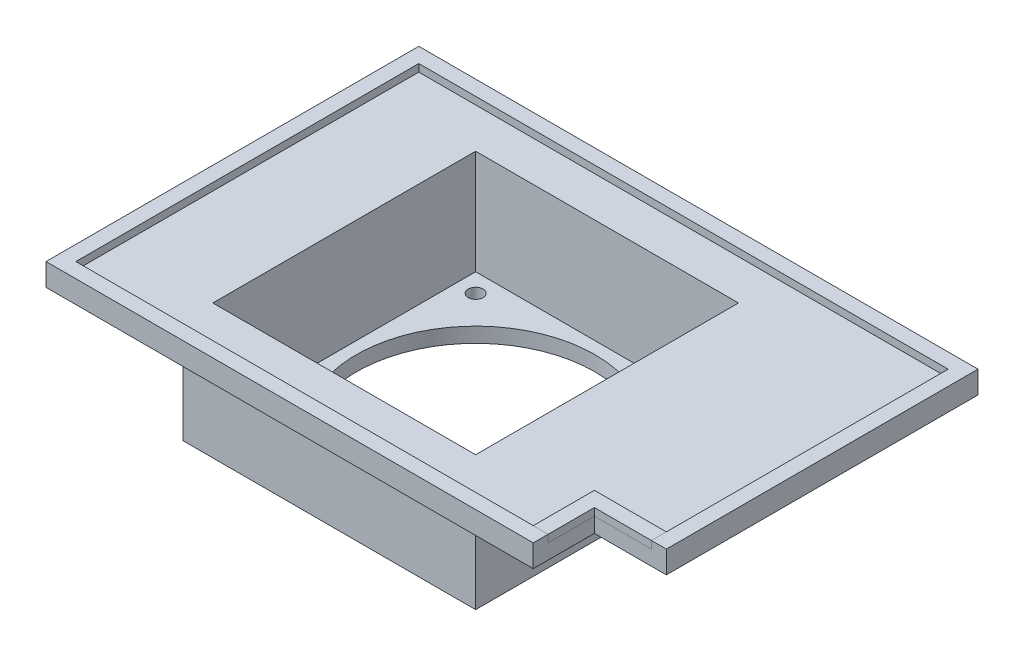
ISO-10303-21;
HEADER;
FILE_DESCRIPTION(('STEP AP214'),'2;1');
FILE_NAME('part.step','',(''),(''),'','','');
FILE_SCHEMA(('AUTOMOTIVE_DESIGN { 1 0 10303 214 1 1 1 1 }'));
ENDSEC;
DATA;
#1=APPLICATION_CONTEXT('core data for automotive mechanical design processes');
#2=APPLICATION_PROTOCOL_DEFINITION('international standard','automotive_design',2000,#1);
#3=PRODUCT_CONTEXT('',#1,'mechanical');
#4=PRODUCT('Part','Part','',(#3));
#5=PRODUCT_RELATED_PRODUCT_CATEGORY('part','',(#4));
#6=PRODUCT_DEFINITION_FORMATION('','',#4);
#7=PRODUCT_DEFINITION_CONTEXT('part definition',#1,'design');
#8=PRODUCT_DEFINITION('design','',#6,#7);
#9=PRODUCT_DEFINITION_SHAPE('','',#8);
#10=(LENGTH_UNIT() NAMED_UNIT(*) SI_UNIT(.MILLI.,.METRE.));
#11=(NAMED_UNIT(*) PLANE_ANGLE_UNIT() SI_UNIT($,.RADIAN.));
#12=(NAMED_UNIT(*) SI_UNIT($,.STERADIAN.) SOLID_ANGLE_UNIT());
#13=UNCERTAINTY_MEASURE_WITH_UNIT(LENGTH_MEASURE(1.E-05),#10,'distance_accuracy_value','');
#14=(GEOMETRIC_REPRESENTATION_CONTEXT(3) GLOBAL_UNCERTAINTY_ASSIGNED_CONTEXT((#13)) GLOBAL_UNIT_ASSIGNED_CONTEXT((#10,
#11,#12)) REPRESENTATION_CONTEXT('',''));
#15=CARTESIAN_POINT('',(0.,0.,0.));
#16=DIRECTION('',(0.,0.,1.));
#17=DIRECTION('',(1.,0.,0.));
#18=AXIS2_PLACEMENT_3D('',#15,#16,#17);
#19=CARTESIAN_POINT('',(126.7,6.,0.));
#20=DIRECTION('',(-1.,0.,0.));
#21=DIRECTION('',(0.,0.,1.));
#22=AXIS2_PLACEMENT_3D('',#19,#20,#21);
#23=PLANE('',#22);
#24=DIRECTION('',(0.,0.,-1.));
#25=VECTOR('',#24,1.);
#26=CARTESIAN_POINT('',(126.7,4.,0.));
#27=LINE('',#26,#25);
#28=CARTESIAN_POINT('',(126.7,4.,-4.));
#29=VERTEX_POINT('',#28);
#30=CARTESIAN_POINT('',(126.7,4.,-20.4));
#31=VERTEX_POINT('',#30);
#32=EDGE_CURVE('E137',#29,#31,#27,.T.);
#33=ORIENTED_EDGE('',*,*,#32,.F.);
#34=DIRECTION('',(0.,-1.,0.));
#35=VECTOR('',#34,1.);
#36=CARTESIAN_POINT('',(126.7,6.,-4.));
#37=LINE('',#36,#35);
#38=CARTESIAN_POINT('',(126.7,6.,-4.));
#39=VERTEX_POINT('',#38);
#40=EDGE_CURVE('E12',#39,#29,#37,.T.);
#41=ORIENTED_EDGE('',*,*,#40,.F.);
#42=DIRECTION('',(0.,0.,-1.));
#43=VECTOR('',#42,1.);
#44=CARTESIAN_POINT('',(126.7,6.,0.));
#45=LINE('',#44,#43);
#46=CARTESIAN_POINT('',(126.7,6.,-20.4));
#47=VERTEX_POINT('',#46);
#48=EDGE_CURVE('E149',#39,#47,#45,.T.);
#49=ORIENTED_EDGE('',*,*,#48,.T.);
#50=DIRECTION('',(0.,-1.,0.));
#51=VECTOR('',#50,1.);
#52=CARTESIAN_POINT('',(126.7,6.,-20.4));
#53=LINE('',#52,#51);
#54=EDGE_CURVE('E99',#47,#31,#53,.T.);
#55=ORIENTED_EDGE('',*,*,#54,.T.);
#56=EDGE_LOOP('',(#33,#41,#49,#55));
#57=FACE_BOUND('',#56,.T.);
#58=ADVANCED_FACE('F55',(#57),#23,.T.);
#59=CARTESIAN_POINT('',(0.,6.,-4.));
#60=DIRECTION('',(0.,0.,-1.));
#61=DIRECTION('',(-1.,0.,0.));
#62=AXIS2_PLACEMENT_3D('',#59,#60,#61);
#63=PLANE('',#62);
#64=DIRECTION('',(1.,0.,0.));
#65=VECTOR('',#64,1.);
#66=CARTESIAN_POINT('',(0.,4.,-4.));
#67=LINE('',#66,#65);
#68=CARTESIAN_POINT('',(130.7,4.,-4.));
#69=VERTEX_POINT('',#68);
#70=EDGE_CURVE('E140',#29,#69,#67,.T.);
#71=ORIENTED_EDGE('',*,*,#70,.T.);
#72=DIRECTION('',(0.,-1.,0.));
#73=VECTOR('',#72,1.);
#74=CARTESIAN_POINT('',(130.7,6.,-4.));
#75=LINE('',#74,#73);
#76=CARTESIAN_POINT('',(130.7,6.,-4.));
#77=VERTEX_POINT('',#76);
#78=EDGE_CURVE('E63',#77,#69,#75,.T.);
#79=ORIENTED_EDGE('',*,*,#78,.F.);
#80=DIRECTION('',(1.,0.,0.));
#81=VECTOR('',#80,1.);
#82=CARTESIAN_POINT('',(0.,6.,-4.));
#83=LINE('',#82,#81);
#84=EDGE_CURVE('E132',#39,#77,#83,.T.);
#85=ORIENTED_EDGE('',*,*,#84,.F.);
#86=ORIENTED_EDGE('',*,*,#40,.T.);
#87=EDGE_LOOP('',(#71,#79,#85,#86));
#88=FACE_BOUND('',#87,.T.);
#89=ADVANCED_FACE('F165',(#88),#63,.F.);
#90=CARTESIAN_POINT('',(130.7,6.,0.));
#91=DIRECTION('',(-1.,0.,0.));
#92=DIRECTION('',(0.,0.,1.));
#93=AXIS2_PLACEMENT_3D('',#90,#91,#92);
#94=PLANE('',#93);
#95=DIRECTION('',(0.,0.,-1.));
#96=VECTOR('',#95,1.);
#97=CARTESIAN_POINT('',(130.7,4.,0.));
#98=LINE('',#97,#96);
#99=CARTESIAN_POINT('',(130.7,4.,-16.4));
#100=VERTEX_POINT('',#99);
#101=EDGE_CURVE('E142',#69,#100,#98,.T.);
#102=ORIENTED_EDGE('',*,*,#101,.T.);
#103=DIRECTION('',(0.,-1.,0.));
#104=VECTOR('',#103,1.);
#105=CARTESIAN_POINT('',(130.7,6.,-16.4));
#106=LINE('',#105,#104);
#107=CARTESIAN_POINT('',(130.7,6.,-16.4));
#108=VERTEX_POINT('',#107);
#109=EDGE_CURVE('E121',#108,#100,#106,.T.);
#110=ORIENTED_EDGE('',*,*,#109,.F.);
#111=DIRECTION('',(0.,0.,-1.));
#112=VECTOR('',#111,1.);
#113=CARTESIAN_POINT('',(130.7,6.,0.));
#114=LINE('',#113,#112);
#115=EDGE_CURVE('E129',#77,#108,#114,.T.);
#116=ORIENTED_EDGE('',*,*,#115,.F.);
#117=ORIENTED_EDGE('',*,*,#78,.T.);
#118=EDGE_LOOP('',(#102,#110,#116,#117));
#119=FACE_BOUND('',#118,.T.);
#120=ADVANCED_FACE('F156',(#119),#94,.F.);
#121=CARTESIAN_POINT('',(0.,6.,-16.4));
#122=DIRECTION('',(0.,0.,1.));
#123=DIRECTION('',(1.,0.,0.));
#124=AXIS2_PLACEMENT_3D('',#121,#122,#123);
#125=PLANE('',#124);
#126=DIRECTION('',(-1.,0.,0.));
#127=VECTOR('',#126,1.);
#128=CARTESIAN_POINT('',(0.,4.,-16.4));
#129=LINE('',#128,#127);
#130=CARTESIAN_POINT('',(146.,4.,-16.4));
#131=VERTEX_POINT('',#130);
#132=EDGE_CURVE('E120',#131,#100,#129,.T.);
#133=ORIENTED_EDGE('',*,*,#132,.F.);
#134=DIRECTION('',(0.,-1.,0.));
#135=VECTOR('',#134,1.);
#136=CARTESIAN_POINT('',(146.,6.,-16.4));
#137=LINE('',#136,#135);
#138=CARTESIAN_POINT('',(146.,6.,-16.4));
#139=VERTEX_POINT('',#138);
#140=EDGE_CURVE('E114',#139,#131,#137,.T.);
#141=ORIENTED_EDGE('',*,*,#140,.F.);
#142=DIRECTION('',(-1.,0.,0.));
#143=VECTOR('',#142,1.);
#144=CARTESIAN_POINT('',(0.,6.,-16.4));
#145=LINE('',#144,#143);
#146=EDGE_CURVE('E118',#139,#108,#145,.T.);
#147=ORIENTED_EDGE('',*,*,#146,.T.);
#148=ORIENTED_EDGE('',*,*,#109,.T.);
#149=EDGE_LOOP('',(#133,#141,#147,#148));
#150=FACE_BOUND('',#149,.T.);
#151=ADVANCED_FACE('F116',(#150),#125,.T.);
#152=CARTESIAN_POINT('',(146.,6.,0.));
#153=DIRECTION('',(-1.,0.,0.));
#154=DIRECTION('',(0.,0.,1.));
#155=AXIS2_PLACEMENT_3D('',#152,#153,#154);
#156=PLANE('',#155);
#157=DIRECTION('',(0.,0.,-1.));
#158=VECTOR('',#157,1.);
#159=CARTESIAN_POINT('',(146.,4.,0.));
#160=LINE('',#159,#158);
#161=CARTESIAN_POINT('',(146.,4.,-20.4));
#162=VERTEX_POINT('',#161);
#163=EDGE_CURVE('E92',#131,#162,#160,.T.);
#164=ORIENTED_EDGE('',*,*,#163,.T.);
#165=DIRECTION('',(0.,-1.,0.));
#166=VECTOR('',#165,1.);
#167=CARTESIAN_POINT('',(146.,6.,-20.4));
#168=LINE('',#167,#166);
#169=CARTESIAN_POINT('',(146.,6.,-20.4));
#170=VERTEX_POINT('',#169);
#171=EDGE_CURVE('E122',#170,#162,#168,.T.);
#172=ORIENTED_EDGE('',*,*,#171,.F.);
#173=DIRECTION('',(0.,0.,-1.));
#174=VECTOR('',#173,1.);
#175=CARTESIAN_POINT('',(146.,6.,0.));
#176=LINE('',#175,#174);
#177=EDGE_CURVE('E124',#139,#170,#176,.T.);
#178=ORIENTED_EDGE('',*,*,#177,.F.);
#179=ORIENTED_EDGE('',*,*,#140,.T.);
#180=EDGE_LOOP('',(#164,#172,#178,#179));
#181=FACE_BOUND('',#180,.T.);
#182=ADVANCED_FACE('F125',(#181),#156,.F.);
#183=CARTESIAN_POINT('',(0.,6.,-20.4));
#184=DIRECTION('',(0.,0.,1.));
#185=DIRECTION('',(1.,0.,0.));
#186=AXIS2_PLACEMENT_3D('',#183,#184,#185);
#187=PLANE('',#186);
#188=DIRECTION('',(-1.,0.,0.));
#189=VECTOR('',#188,1.);
#190=CARTESIAN_POINT('',(0.,4.,-20.4));
#191=LINE('',#190,#189);
#192=EDGE_CURVE('E147',#162,#31,#191,.T.);
#193=ORIENTED_EDGE('',*,*,#192,.T.);
#194=ORIENTED_EDGE('',*,*,#54,.F.);
#195=DIRECTION('',(-1.,0.,0.));
#196=VECTOR('',#195,1.);
#197=CARTESIAN_POINT('',(0.,6.,-20.4));
#198=LINE('',#197,#196);
#199=EDGE_CURVE('E71',#170,#47,#198,.T.);
#200=ORIENTED_EDGE('',*,*,#199,.F.);
#201=ORIENTED_EDGE('',*,*,#171,.T.);
#202=EDGE_LOOP('',(#193,#194,#200,#201));
#203=FACE_BOUND('',#202,.T.);
#204=ADVANCED_FACE('F163',(#203),#187,.F.);
#205=CARTESIAN_POINT('',(0.,6.,0.));
#206=DIRECTION('',(0.,1.,0.));
#207=DIRECTION('',(0.,0.,1.));
#208=AXIS2_PLACEMENT_3D('',#205,#206,#207);
#209=PLANE('',#208);
#210=ORIENTED_EDGE('',*,*,#48,.F.);
#211=ORIENTED_EDGE('',*,*,#84,.T.);
#212=ORIENTED_EDGE('',*,*,#115,.T.);
#213=ORIENTED_EDGE('',*,*,#146,.F.);
#214=ORIENTED_EDGE('',*,*,#177,.T.);
#215=ORIENTED_EDGE('',*,*,#199,.T.);
#216=EDGE_LOOP('',(#210,#211,#212,#213,#214,#215));
#217=FACE_BOUND('',#216,.T.);
#218=ADVANCED_FACE('F127',(#217),#209,.T.);
#219=CARTESIAN_POINT('',(0.,4.,0.));
#220=DIRECTION('',(0.,1.,0.));
#221=DIRECTION('',(0.,0.,1.));
#222=AXIS2_PLACEMENT_3D('',#219,#220,#221);
#223=PLANE('',#222);
#224=ORIENTED_EDGE('',*,*,#32,.T.);
#225=ORIENTED_EDGE('',*,*,#192,.F.);
#226=ORIENTED_EDGE('',*,*,#163,.F.);
#227=ORIENTED_EDGE('',*,*,#132,.T.);
#228=ORIENTED_EDGE('',*,*,#101,.F.);
#229=ORIENTED_EDGE('',*,*,#70,.F.);
#230=EDGE_LOOP('',(#224,#225,#226,#227,#228,#229));
#231=FACE_BOUND('',#230,.T.);
#232=ADVANCED_FACE('F160',(#231),#223,.F.);
#233=CLOSED_SHELL('',(#58,#89,#120,#151,#182,#204,#218,#232));
#234=MANIFOLD_SOLID_BREP('B2',#233);
#235=CARTESIAN_POINT('',(0.,0.,0.));
#236=DIRECTION('',(0.,-1.,0.));
#237=DIRECTION('',(0.,0.,-1.));
#238=AXIS2_PLACEMENT_3D('',#235,#236,#237);
#239=PLANE('',#238);
#240=DIRECTION('',(-1.,0.,0.));
#241=VECTOR('',#240,1.);
#242=CARTESIAN_POINT('',(150.,0.,-16.4));
#243=LINE('',#242,#241);
#244=CARTESIAN_POINT('',(150.,0.,-16.4));
#245=VERTEX_POINT('',#244);
#246=CARTESIAN_POINT('',(130.7,0.,-16.4));
#247=VERTEX_POINT('',#246);
#248=EDGE_CURVE('E492',#245,#247,#243,.T.);
#249=ORIENTED_EDGE('',*,*,#248,.T.);
#250=DIRECTION('',(0.,0.,1.));
#251=VECTOR('',#250,1.);
#252=CARTESIAN_POINT('',(130.7,0.,0.));
#253=LINE('',#252,#251);
#254=CARTESIAN_POINT('',(130.7,0.,0.));
#255=VERTEX_POINT('',#254);
#256=EDGE_CURVE('E499',#247,#255,#253,.T.);
#257=ORIENTED_EDGE('',*,*,#256,.T.);
#258=DIRECTION('',(1.,0.,0.));
#259=VECTOR('',#258,1.);
#260=CARTESIAN_POINT('',(0.,0.,0.));
#261=LINE('',#260,#259);
#262=CARTESIAN_POINT('',(0.,0.,0.));
#263=VERTEX_POINT('',#262);
#264=EDGE_CURVE('E577',#263,#255,#261,.T.);
#265=ORIENTED_EDGE('',*,*,#264,.F.);
#266=DIRECTION('',(0.,0.,1.));
#267=VECTOR('',#266,1.);
#268=CARTESIAN_POINT('',(0.,0.,0.));
#269=LINE('',#268,#267);
#270=CARTESIAN_POINT('',(0.,0.,-100.));
#271=VERTEX_POINT('',#270);
#272=EDGE_CURVE('E557',#271,#263,#269,.T.);
#273=ORIENTED_EDGE('',*,*,#272,.F.);
#274=DIRECTION('',(-1.,0.,0.));
#275=VECTOR('',#274,1.);
#276=CARTESIAN_POINT('',(0.,0.,-100.));
#277=LINE('',#276,#275);
#278=CARTESIAN_POINT('',(150.,0.,-100.));
#279=VERTEX_POINT('',#278);
#280=EDGE_CURVE('E563',#279,#271,#277,.T.);
#281=ORIENTED_EDGE('',*,*,#280,.F.);
#282=DIRECTION('',(0.,0.,-1.));
#283=VECTOR('',#282,1.);
#284=CARTESIAN_POINT('',(150.,0.,0.));
#285=LINE('',#284,#283);
#286=EDGE_CURVE('E581',#245,#279,#285,.T.);
#287=ORIENTED_EDGE('',*,*,#286,.F.);
#288=EDGE_LOOP('',(#249,#257,#265,#273,#281,#287));
#289=FACE_BOUND('',#288,.T.);
#290=DIRECTION('',(0.,0.,-1.));
#291=VECTOR('',#290,1.);
#292=CARTESIAN_POINT('',(26.,0.,0.));
#293=LINE('',#292,#291);
#294=CARTESIAN_POINT('',(26.,0.,-10.75));
#295=VERTEX_POINT('',#294);
#296=CARTESIAN_POINT('',(26.,0.,-89.25));
#297=VERTEX_POINT('',#296);
#298=EDGE_CURVE('E295',#295,#297,#293,.T.);
#299=ORIENTED_EDGE('',*,*,#298,.F.);
#300=DIRECTION('',(-1.,0.,0.));
#301=VECTOR('',#300,1.);
#302=CARTESIAN_POINT('',(0.,0.,-10.75));
#303=LINE('',#302,#301);
#304=CARTESIAN_POINT('',(104.5,0.,-10.7499999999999));
#305=VERTEX_POINT('',#304);
#306=EDGE_CURVE('E444',#305,#295,#303,.T.);
#307=ORIENTED_EDGE('',*,*,#306,.F.);
#308=DIRECTION('',(0.,0.,-1.));
#309=VECTOR('',#308,1.);
#310=CARTESIAN_POINT('',(104.5,0.,0.));
#311=LINE('',#310,#309);
#312=CARTESIAN_POINT('',(104.5,0.,-89.25));
#313=VERTEX_POINT('',#312);
#314=EDGE_CURVE('E450',#305,#313,#311,.T.);
#315=ORIENTED_EDGE('',*,*,#314,.T.);
#316=DIRECTION('',(-1.,0.,0.));
#317=VECTOR('',#316,1.);
#318=CARTESIAN_POINT('',(0.,0.,-89.25));
#319=LINE('',#318,#317);
#320=EDGE_CURVE('E465',#313,#297,#319,.T.);
#321=ORIENTED_EDGE('',*,*,#320,.T.);
#322=EDGE_LOOP('',(#299,#307,#315,#321));
#323=FACE_BOUND('',#322,.T.);
#324=ADVANCED_FACE('F271',(#289,#323),#239,.T.);
#325=CARTESIAN_POINT('',(0.,6.,0.));
#326=DIRECTION('',(0.,-1.,0.));
#327=DIRECTION('',(0.,0.,-1.));
#328=AXIS2_PLACEMENT_3D('',#325,#326,#327);
#329=PLANE('',#328);
#330=DIRECTION('',(0.,0.,-1.));
#331=VECTOR('',#330,1.);
#332=CARTESIAN_POINT('',(146.,6.,-4.));
#333=LINE('',#332,#331);
#334=CARTESIAN_POINT('',(146.,6.,-16.4));
#335=VERTEX_POINT('',#334);
#336=CARTESIAN_POINT('',(146.,6.,-96.));
#337=VERTEX_POINT('',#336);
#338=EDGE_CURVE('E540',#335,#337,#333,.T.);
#339=ORIENTED_EDGE('',*,*,#338,.F.);
#340=DIRECTION('',(-1.,0.,0.));
#341=VECTOR('',#340,1.);
#342=CARTESIAN_POINT('',(150.,6.,-16.4));
#343=LINE('',#342,#341);
#344=CARTESIAN_POINT('',(150.,6.,-16.4));
#345=VERTEX_POINT('',#344);
#346=EDGE_CURVE('E479',#345,#335,#343,.T.);
#347=ORIENTED_EDGE('',*,*,#346,.F.);
#348=DIRECTION('',(0.,0.,-1.));
#349=VECTOR('',#348,1.);
#350=CARTESIAN_POINT('',(150.,6.,0.));
#351=LINE('',#350,#349);
#352=CARTESIAN_POINT('',(150.,6.,-100.));
#353=VERTEX_POINT('',#352);
#354=EDGE_CURVE('E567',#345,#353,#351,.T.);
#355=ORIENTED_EDGE('',*,*,#354,.T.);
#356=DIRECTION('',(-1.,0.,0.));
#357=VECTOR('',#356,1.);
#358=CARTESIAN_POINT('',(0.,6.,-100.));
#359=LINE('',#358,#357);
#360=CARTESIAN_POINT('',(0.,6.,-100.));
#361=VERTEX_POINT('',#360);
#362=EDGE_CURVE('E570',#353,#361,#359,.T.);
#363=ORIENTED_EDGE('',*,*,#362,.T.);
#364=DIRECTION('',(0.,0.,1.));
#365=VECTOR('',#364,1.);
#366=CARTESIAN_POINT('',(0.,6.,0.));
#367=LINE('',#366,#365);
#368=CARTESIAN_POINT('',(0.,6.,0.));
#369=VERTEX_POINT('',#368);
#370=EDGE_CURVE('E558',#361,#369,#367,.T.);
#371=ORIENTED_EDGE('',*,*,#370,.T.);
#372=DIRECTION('',(1.,0.,0.));
#373=VECTOR('',#372,1.);
#374=CARTESIAN_POINT('',(0.,6.,0.));
#375=LINE('',#374,#373);
#376=CARTESIAN_POINT('',(130.7,6.,0.));
#377=VERTEX_POINT('',#376);
#378=EDGE_CURVE('E562',#369,#377,#375,.T.);
#379=ORIENTED_EDGE('',*,*,#378,.T.);
#380=DIRECTION('',(0.,0.,1.));
#381=VECTOR('',#380,1.);
#382=CARTESIAN_POINT('',(130.7,6.,0.));
#383=LINE('',#382,#381);
#384=CARTESIAN_POINT('',(130.7,6.,-4.));
#385=VERTEX_POINT('',#384);
#386=EDGE_CURVE('E489',#385,#377,#383,.T.);
#387=ORIENTED_EDGE('',*,*,#386,.F.);
#388=DIRECTION('',(1.,0.,0.));
#389=VECTOR('',#388,1.);
#390=CARTESIAN_POINT('',(4.,6.,-4.));
#391=LINE('',#390,#389);
#392=CARTESIAN_POINT('',(4.,6.,-4.));
#393=VERTEX_POINT('',#392);
#394=EDGE_CURVE('E536',#393,#385,#391,.T.);
#395=ORIENTED_EDGE('',*,*,#394,.F.);
#396=DIRECTION('',(0.,0.,1.));
#397=VECTOR('',#396,1.);
#398=CARTESIAN_POINT('',(4.,6.,-4.));
#399=LINE('',#398,#397);
#400=CARTESIAN_POINT('',(4.,6.,-96.));
#401=VERTEX_POINT('',#400);
#402=EDGE_CURVE('E533',#401,#393,#399,.T.);
#403=ORIENTED_EDGE('',*,*,#402,.F.);
#404=DIRECTION('',(-1.,0.,0.));
#405=VECTOR('',#404,1.);
#406=CARTESIAN_POINT('',(4.,6.,-96.));
#407=LINE('',#406,#405);
#408=EDGE_CURVE('E543',#337,#401,#407,.T.);
#409=ORIENTED_EDGE('',*,*,#408,.F.);
#410=EDGE_LOOP('',(#339,#347,#355,#363,#371,#379,#387,#395,#403,#409));
#411=FACE_BOUND('',#410,.T.);
#412=ADVANCED_FACE('F642',(#411),#329,.F.);
#413=CARTESIAN_POINT('',(0.,6.,0.));
#414=DIRECTION('',(1.,0.,0.));
#415=DIRECTION('',(0.,0.,-1.));
#416=AXIS2_PLACEMENT_3D('',#413,#414,#415);
#417=PLANE('',#416);
#418=ORIENTED_EDGE('',*,*,#272,.T.);
#419=DIRECTION('',(0.,-1.,0.));
#420=VECTOR('',#419,1.);
#421=CARTESIAN_POINT('',(0.,6.,0.));
#422=LINE('',#421,#420);
#423=EDGE_CURVE('E593',#369,#263,#422,.T.);
#424=ORIENTED_EDGE('',*,*,#423,.F.);
#425=ORIENTED_EDGE('',*,*,#370,.F.);
#426=DIRECTION('',(0.,-1.,0.));
#427=VECTOR('',#426,1.);
#428=CARTESIAN_POINT('',(0.,6.,-100.));
#429=LINE('',#428,#427);
#430=EDGE_CURVE('E573',#361,#271,#429,.T.);
#431=ORIENTED_EDGE('',*,*,#430,.T.);
#432=EDGE_LOOP('',(#418,#424,#425,#431));
#433=FACE_BOUND('',#432,.T.);
#434=ADVANCED_FACE('F273',(#433),#417,.F.);
#435=CARTESIAN_POINT('',(0.,6.,0.));
#436=DIRECTION('',(0.,0.,-1.));
#437=DIRECTION('',(-1.,0.,0.));
#438=AXIS2_PLACEMENT_3D('',#435,#436,#437);
#439=PLANE('',#438);
#440=ORIENTED_EDGE('',*,*,#264,.T.);
#441=DIRECTION('',(0.,1.,0.));
#442=VECTOR('',#441,1.);
#443=CARTESIAN_POINT('',(130.7,-25.326863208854,0.));
#444=LINE('',#443,#442);
#445=EDGE_CURVE('E503',#255,#377,#444,.T.);
#446=ORIENTED_EDGE('',*,*,#445,.T.);
#447=ORIENTED_EDGE('',*,*,#378,.F.);
#448=ORIENTED_EDGE('',*,*,#423,.T.);
#449=EDGE_LOOP('',(#440,#446,#447,#448));
#450=FACE_BOUND('',#449,.T.);
#451=ADVANCED_FACE('F659',(#450),#439,.F.);
#452=CARTESIAN_POINT('',(150.,6.,0.));
#453=DIRECTION('',(-1.,0.,0.));
#454=DIRECTION('',(0.,0.,1.));
#455=AXIS2_PLACEMENT_3D('',#452,#453,#454);
#456=PLANE('',#455);
#457=ORIENTED_EDGE('',*,*,#354,.F.);
#458=DIRECTION('',(0.,1.,0.));
#459=VECTOR('',#458,1.);
#460=CARTESIAN_POINT('',(150.,-25.326863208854,-16.4));
#461=LINE('',#460,#459);
#462=EDGE_CURVE('E507',#245,#345,#461,.T.);
#463=ORIENTED_EDGE('',*,*,#462,.F.);
#464=ORIENTED_EDGE('',*,*,#286,.T.);
#465=DIRECTION('',(0.,-1.,0.));
#466=VECTOR('',#465,1.);
#467=CARTESIAN_POINT('',(150.,6.,-100.));
#468=LINE('',#467,#466);
#469=EDGE_CURVE('E589',#353,#279,#468,.T.);
#470=ORIENTED_EDGE('',*,*,#469,.F.);
#471=EDGE_LOOP('',(#457,#463,#464,#470));
#472=FACE_BOUND('',#471,.T.);
#473=ADVANCED_FACE('F656',(#472),#456,.F.);
#474=CARTESIAN_POINT('',(0.,6.,-100.));
#475=DIRECTION('',(0.,0.,1.));
#476=DIRECTION('',(1.,0.,0.));
#477=AXIS2_PLACEMENT_3D('',#474,#475,#476);
#478=PLANE('',#477);
#479=ORIENTED_EDGE('',*,*,#280,.T.);
#480=ORIENTED_EDGE('',*,*,#430,.F.);
#481=ORIENTED_EDGE('',*,*,#362,.F.);
#482=ORIENTED_EDGE('',*,*,#469,.T.);
#483=EDGE_LOOP('',(#479,#480,#481,#482));
#484=FACE_BOUND('',#483,.T.);
#485=ADVANCED_FACE('F652',(#484),#478,.F.);
#486=CARTESIAN_POINT('',(4.,6.,-4.));
#487=DIRECTION('',(1.,0.,0.));
#488=DIRECTION('',(0.,0.,-1.));
#489=AXIS2_PLACEMENT_3D('',#486,#487,#488);
#490=PLANE('',#489);
#491=DIRECTION('',(0.,0.,-1.));
#492=VECTOR('',#491,1.);
#493=CARTESIAN_POINT('',(4.,4.,0.));
#494=LINE('',#493,#492);
#495=CARTESIAN_POINT('',(4.,4.,-4.));
#496=VERTEX_POINT('',#495);
#497=CARTESIAN_POINT('',(4.,4.,-96.));
#498=VERTEX_POINT('',#497);
#499=EDGE_CURVE('E529',#496,#498,#494,.T.);
#500=ORIENTED_EDGE('',*,*,#499,.T.);
#501=DIRECTION('',(0.,-1.,0.));
#502=VECTOR('',#501,1.);
#503=CARTESIAN_POINT('',(4.,6.,-96.));
#504=LINE('',#503,#502);
#505=EDGE_CURVE('E546',#401,#498,#504,.T.);
#506=ORIENTED_EDGE('',*,*,#505,.F.);
#507=ORIENTED_EDGE('',*,*,#402,.T.);
#508=DIRECTION('',(0.,-1.,0.));
#509=VECTOR('',#508,1.);
#510=CARTESIAN_POINT('',(4.,6.,-4.));
#511=LINE('',#510,#509);
#512=EDGE_CURVE('E553',#393,#496,#511,.T.);
#513=ORIENTED_EDGE('',*,*,#512,.T.);
#514=EDGE_LOOP('',(#500,#506,#507,#513));
#515=FACE_BOUND('',#514,.T.);
#516=ADVANCED_FACE('F655',(#515),#490,.T.);
#517=CARTESIAN_POINT('',(4.,6.,-4.));
#518=DIRECTION('',(0.,0.,-1.));
#519=DIRECTION('',(-1.,0.,0.));
#520=AXIS2_PLACEMENT_3D('',#517,#518,#519);
#521=PLANE('',#520);
#522=DIRECTION('',(0.,1.,0.));
#523=VECTOR('',#522,1.);
#524=CARTESIAN_POINT('',(130.7,6.,-4.));
#525=LINE('',#524,#523);
#526=CARTESIAN_POINT('',(130.7,4.,-4.));
#527=VERTEX_POINT('',#526);
#528=EDGE_CURVE('E512',#527,#385,#525,.T.);
#529=ORIENTED_EDGE('',*,*,#528,.F.);
#530=DIRECTION('',(1.,0.,0.));
#531=VECTOR('',#530,1.);
#532=CARTESIAN_POINT('',(0.,4.,-4.));
#533=LINE('',#532,#531);
#534=EDGE_CURVE('E518',#496,#527,#533,.T.);
#535=ORIENTED_EDGE('',*,*,#534,.F.);
#536=ORIENTED_EDGE('',*,*,#512,.F.);
#537=ORIENTED_EDGE('',*,*,#394,.T.);
#538=EDGE_LOOP('',(#529,#535,#536,#537));
#539=FACE_BOUND('',#538,.T.);
#540=ADVANCED_FACE('F685',(#539),#521,.T.);
#541=CARTESIAN_POINT('',(146.,6.,-4.));
#542=DIRECTION('',(-1.,0.,0.));
#543=DIRECTION('',(0.,0.,1.));
#544=AXIS2_PLACEMENT_3D('',#541,#542,#543);
#545=PLANE('',#544);
#546=DIRECTION('',(0.,-1.,0.));
#547=VECTOR('',#546,1.);
#548=CARTESIAN_POINT('',(146.,6.,-16.4));
#549=LINE('',#548,#547);
#550=CARTESIAN_POINT('',(146.,4.,-16.4));
#551=VERTEX_POINT('',#550);
#552=EDGE_CURVE('E515',#335,#551,#549,.T.);
#553=ORIENTED_EDGE('',*,*,#552,.F.);
#554=ORIENTED_EDGE('',*,*,#338,.T.);
#555=DIRECTION('',(0.,-1.,0.));
#556=VECTOR('',#555,1.);
#557=CARTESIAN_POINT('',(146.,6.,-96.));
#558=LINE('',#557,#556);
#559=CARTESIAN_POINT('',(146.,4.,-96.));
#560=VERTEX_POINT('',#559);
#561=EDGE_CURVE('E549',#337,#560,#558,.T.);
#562=ORIENTED_EDGE('',*,*,#561,.T.);
#563=DIRECTION('',(0.,0.,-1.));
#564=VECTOR('',#563,1.);
#565=CARTESIAN_POINT('',(146.,4.,0.));
#566=LINE('',#565,#564);
#567=EDGE_CURVE('E522',#551,#560,#566,.T.);
#568=ORIENTED_EDGE('',*,*,#567,.F.);
#569=EDGE_LOOP('',(#553,#554,#562,#568));
#570=FACE_BOUND('',#569,.T.);
#571=ADVANCED_FACE('F699',(#570),#545,.T.);
#572=CARTESIAN_POINT('',(4.,6.,-96.));
#573=DIRECTION('',(0.,0.,1.));
#574=DIRECTION('',(1.,0.,0.));
#575=AXIS2_PLACEMENT_3D('',#572,#573,#574);
#576=PLANE('',#575);
#577=DIRECTION('',(1.,0.,0.));
#578=VECTOR('',#577,1.);
#579=CARTESIAN_POINT('',(0.,4.,-96.));
#580=LINE('',#579,#578);
#581=EDGE_CURVE('E525',#498,#560,#580,.T.);
#582=ORIENTED_EDGE('',*,*,#581,.T.);
#583=ORIENTED_EDGE('',*,*,#561,.F.);
#584=ORIENTED_EDGE('',*,*,#408,.T.);
#585=ORIENTED_EDGE('',*,*,#505,.T.);
#586=EDGE_LOOP('',(#582,#583,#584,#585));
#587=FACE_BOUND('',#586,.T.);
#588=ADVANCED_FACE('F701',(#587),#576,.T.);
#589=CARTESIAN_POINT('',(0.,4.,0.));
#590=DIRECTION('',(0.,1.,0.));
#591=DIRECTION('',(0.,0.,1.));
#592=AXIS2_PLACEMENT_3D('',#589,#590,#591);
#593=PLANE('',#592);
#594=DIRECTION('',(-1.,0.,0.));
#595=VECTOR('',#594,1.);
#596=CARTESIAN_POINT('',(0.,4.,-85.25));
#597=LINE('',#596,#595);
#598=CARTESIAN_POINT('',(100.5,4.,-85.25));
#599=VERTEX_POINT('',#598);
#600=CARTESIAN_POINT('',(30.,4.,-85.25));
#601=VERTEX_POINT('',#600);
#602=EDGE_CURVE('E53',#599,#601,#597,.T.);
#603=ORIENTED_EDGE('',*,*,#602,.F.);
#604=DIRECTION('',(0.,0.,-1.));
#605=VECTOR('',#604,1.);
#606=CARTESIAN_POINT('',(100.5,4.,0.));
#607=LINE('',#606,#605);
#608=CARTESIAN_POINT('',(100.5,4.,-14.75));
#609=VERTEX_POINT('',#608);
#610=EDGE_CURVE('E604',#609,#599,#607,.T.);
#611=ORIENTED_EDGE('',*,*,#610,.F.);
#612=DIRECTION('',(-1.,0.,0.));
#613=VECTOR('',#612,1.);
#614=CARTESIAN_POINT('',(0.,4.,-14.75));
#615=LINE('',#614,#613);
#616=CARTESIAN_POINT('',(30.,4.,-14.75));
#617=VERTEX_POINT('',#616);
#618=EDGE_CURVE('E607',#609,#617,#615,.T.);
#619=ORIENTED_EDGE('',*,*,#618,.T.);
#620=DIRECTION('',(0.,0.,-1.));
#621=VECTOR('',#620,1.);
#622=CARTESIAN_POINT('',(30.,4.,0.));
#623=LINE('',#622,#621);
#624=EDGE_CURVE('E280',#617,#601,#623,.T.);
#625=ORIENTED_EDGE('',*,*,#624,.T.);
#626=EDGE_LOOP('',(#603,#611,#619,#625));
#627=FACE_BOUND('',#626,.T.);
#628=DIRECTION('',(-1.,0.,0.));
#629=VECTOR('',#628,1.);
#630=CARTESIAN_POINT('',(0.,4.,-16.4));
#631=LINE('',#630,#629);
#632=CARTESIAN_POINT('',(130.7,4.,-16.4));
#633=VERTEX_POINT('',#632);
#634=EDGE_CURVE('E600',#551,#633,#631,.T.);
#635=ORIENTED_EDGE('',*,*,#634,.F.);
#636=ORIENTED_EDGE('',*,*,#567,.T.);
#637=ORIENTED_EDGE('',*,*,#581,.F.);
#638=ORIENTED_EDGE('',*,*,#499,.F.);
#639=ORIENTED_EDGE('',*,*,#534,.T.);
#640=DIRECTION('',(0.,0.,1.));
#641=VECTOR('',#640,1.);
#642=CARTESIAN_POINT('',(130.7,4.,0.));
#643=LINE('',#642,#641);
#644=EDGE_CURVE('E597',#633,#527,#643,.T.);
#645=ORIENTED_EDGE('',*,*,#644,.F.);
#646=EDGE_LOOP('',(#635,#636,#637,#638,#639,#645));
#647=FACE_BOUND('',#646,.T.);
#648=ADVANCED_FACE('F615',(#627,#647),#593,.T.);
#649=CARTESIAN_POINT('',(150.,-25.326863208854,-16.4));
#650=DIRECTION('',(0.,0.,-1.));
#651=DIRECTION('',(-1.,0.,0.));
#652=AXIS2_PLACEMENT_3D('',#649,#650,#651);
#653=PLANE('',#652);
#654=ORIENTED_EDGE('',*,*,#552,.T.);
#655=ORIENTED_EDGE('',*,*,#634,.T.);
#656=DIRECTION('',(0.,1.,0.));
#657=VECTOR('',#656,1.);
#658=CARTESIAN_POINT('',(130.7,-25.326863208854,-16.4));
#659=LINE('',#658,#657);
#660=EDGE_CURVE('E498',#247,#633,#659,.T.);
#661=ORIENTED_EDGE('',*,*,#660,.F.);
#662=ORIENTED_EDGE('',*,*,#248,.F.);
#663=ORIENTED_EDGE('',*,*,#462,.T.);
#664=ORIENTED_EDGE('',*,*,#346,.T.);
#665=EDGE_LOOP('',(#654,#655,#661,#662,#663,#664));
#666=FACE_BOUND('',#665,.T.);
#667=ADVANCED_FACE('F675',(#666),#653,.F.);
#668=CARTESIAN_POINT('',(130.7,-25.326863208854,0.));
#669=DIRECTION('',(-1.,0.,0.));
#670=DIRECTION('',(0.,0.,1.));
#671=AXIS2_PLACEMENT_3D('',#668,#669,#670);
#672=PLANE('',#671);
#673=ORIENTED_EDGE('',*,*,#528,.T.);
#674=ORIENTED_EDGE('',*,*,#386,.T.);
#675=ORIENTED_EDGE('',*,*,#445,.F.);
#676=ORIENTED_EDGE('',*,*,#256,.F.);
#677=ORIENTED_EDGE('',*,*,#660,.T.);
#678=ORIENTED_EDGE('',*,*,#644,.T.);
#679=EDGE_LOOP('',(#673,#674,#675,#676,#677,#678));
#680=FACE_BOUND('',#679,.T.);
#681=ADVANCED_FACE('F673',(#680),#672,.F.);
#682=CARTESIAN_POINT('',(0.,-24.,-10.75));
#683=DIRECTION('',(0.,0.,-1.));
#684=DIRECTION('',(-1.,0.,0.));
#685=AXIS2_PLACEMENT_3D('',#682,#683,#684);
#686=PLANE('',#685);
#687=ORIENTED_EDGE('',*,*,#306,.T.);
#688=DIRECTION('',(0.,1.,0.));
#689=VECTOR('',#688,1.);
#690=CARTESIAN_POINT('',(26.,-24.,-10.75));
#691=LINE('',#690,#689);
#692=CARTESIAN_POINT('',(26.,-28.,-10.75));
#693=VERTEX_POINT('',#692);
#694=EDGE_CURVE('E413',#693,#295,#691,.T.);
#695=ORIENTED_EDGE('',*,*,#694,.F.);
#696=DIRECTION('',(-1.,0.,0.));
#697=VECTOR('',#696,1.);
#698=CARTESIAN_POINT('',(26.,-28.,-10.75));
#699=LINE('',#698,#697);
#700=CARTESIAN_POINT('',(104.5,-28.,-10.75));
#701=VERTEX_POINT('',#700);
#702=EDGE_CURVE('E430',#701,#693,#699,.T.);
#703=ORIENTED_EDGE('',*,*,#702,.F.);
#704=DIRECTION('',(0.,1.,0.));
#705=VECTOR('',#704,1.);
#706=CARTESIAN_POINT('',(104.5,-24.,-10.7499999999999));
#707=LINE('',#706,#705);
#708=EDGE_CURVE('E470',#701,#305,#707,.T.);
#709=ORIENTED_EDGE('',*,*,#708,.T.);
#710=EDGE_LOOP('',(#687,#695,#703,#709));
#711=FACE_BOUND('',#710,.T.);
#712=ADVANCED_FACE('F721',(#711),#686,.F.);
#713=CARTESIAN_POINT('',(26.,-24.,0.));
#714=DIRECTION('',(1.,0.,0.));
#715=DIRECTION('',(0.,0.,-1.));
#716=AXIS2_PLACEMENT_3D('',#713,#714,#715);
#717=PLANE('',#716);
#718=ORIENTED_EDGE('',*,*,#298,.T.);
#719=DIRECTION('',(0.,1.,0.));
#720=VECTOR('',#719,1.);
#721=CARTESIAN_POINT('',(26.,-24.,-89.25));
#722=LINE('',#721,#720);
#723=CARTESIAN_POINT('',(26.,-28.,-89.25));
#724=VERTEX_POINT('',#723);
#725=EDGE_CURVE('E405',#724,#297,#722,.T.);
#726=ORIENTED_EDGE('',*,*,#725,.F.);
#727=DIRECTION('',(0.,0.,-1.));
#728=VECTOR('',#727,1.);
#729=CARTESIAN_POINT('',(26.,-28.,-10.75));
#730=LINE('',#729,#728);
#731=EDGE_CURVE('E409',#693,#724,#730,.T.);
#732=ORIENTED_EDGE('',*,*,#731,.F.);
#733=ORIENTED_EDGE('',*,*,#694,.T.);
#734=EDGE_LOOP('',(#718,#726,#732,#733));
#735=FACE_BOUND('',#734,.T.);
#736=ADVANCED_FACE('F407',(#735),#717,.F.);
#737=CARTESIAN_POINT('',(0.,-24.,-89.25));
#738=DIRECTION('',(0.,0.,-1.));
#739=DIRECTION('',(-1.,0.,0.));
#740=AXIS2_PLACEMENT_3D('',#737,#738,#739);
#741=PLANE('',#740);
#742=ORIENTED_EDGE('',*,*,#320,.F.);
#743=DIRECTION('',(0.,1.,0.));
#744=VECTOR('',#743,1.);
#745=CARTESIAN_POINT('',(104.5,-24.,-89.25));
#746=LINE('',#745,#744);
#747=CARTESIAN_POINT('',(104.5,-28.,-89.25));
#748=VERTEX_POINT('',#747);
#749=EDGE_CURVE('E414',#748,#313,#746,.T.);
#750=ORIENTED_EDGE('',*,*,#749,.F.);
#751=DIRECTION('',(1.,0.,0.));
#752=VECTOR('',#751,1.);
#753=CARTESIAN_POINT('',(26.,-28.,-89.25));
#754=LINE('',#753,#752);
#755=EDGE_CURVE('E417',#724,#748,#754,.T.);
#756=ORIENTED_EDGE('',*,*,#755,.F.);
#757=ORIENTED_EDGE('',*,*,#725,.T.);
#758=EDGE_LOOP('',(#742,#750,#756,#757));
#759=FACE_BOUND('',#758,.T.);
#760=ADVANCED_FACE('F418',(#759),#741,.T.);
#761=CARTESIAN_POINT('',(0.,-24.,-85.25));
#762=DIRECTION('',(0.,0.,1.));
#763=DIRECTION('',(1.,0.,0.));
#764=AXIS2_PLACEMENT_3D('',#761,#762,#763);
#765=PLANE('',#764);
#766=DIRECTION('',(0.,1.,0.));
#767=VECTOR('',#766,1.);
#768=CARTESIAN_POINT('',(100.5,-24.,-85.25));
#769=LINE('',#768,#767);
#770=CARTESIAN_POINT('',(100.5,-24.,-85.25));
#771=VERTEX_POINT('',#770);
#772=EDGE_CURVE('E459',#771,#599,#769,.T.);
#773=ORIENTED_EDGE('',*,*,#772,.T.);
#774=ORIENTED_EDGE('',*,*,#602,.T.);
#775=DIRECTION('',(0.,1.,0.));
#776=VECTOR('',#775,1.);
#777=CARTESIAN_POINT('',(30.,-24.,-85.25));
#778=LINE('',#777,#776);
#779=CARTESIAN_POINT('',(30.,-24.,-85.25));
#780=VERTEX_POINT('',#779);
#781=EDGE_CURVE('E474',#780,#601,#778,.T.);
#782=ORIENTED_EDGE('',*,*,#781,.F.);
#783=DIRECTION('',(1.,0.,0.));
#784=VECTOR('',#783,1.);
#785=CARTESIAN_POINT('',(0.,-24.,-85.25));
#786=LINE('',#785,#784);
#787=EDGE_CURVE('E445',#780,#771,#786,.T.);
#788=ORIENTED_EDGE('',*,*,#787,.T.);
#789=EDGE_LOOP('',(#773,#774,#782,#788));
#790=FACE_BOUND('',#789,.T.);
#791=ADVANCED_FACE('F625',(#790),#765,.T.);
#792=CARTESIAN_POINT('',(30.,-24.,0.));
#793=DIRECTION('',(-1.,0.,0.));
#794=DIRECTION('',(0.,0.,1.));
#795=AXIS2_PLACEMENT_3D('',#792,#793,#794);
#796=PLANE('',#795);
#797=ORIENTED_EDGE('',*,*,#781,.T.);
#798=ORIENTED_EDGE('',*,*,#624,.F.);
#799=DIRECTION('',(0.,1.,0.));
#800=VECTOR('',#799,1.);
#801=CARTESIAN_POINT('',(30.,-24.,-14.75));
#802=LINE('',#801,#800);
#803=CARTESIAN_POINT('',(30.,-24.,-14.75));
#804=VERTEX_POINT('',#803);
#805=EDGE_CURVE('E484',#804,#617,#802,.T.);
#806=ORIENTED_EDGE('',*,*,#805,.F.);
#807=DIRECTION('',(0.,0.,1.));
#808=VECTOR('',#807,1.);
#809=CARTESIAN_POINT('',(30.,-24.,0.));
#810=LINE('',#809,#808);
#811=EDGE_CURVE('E449',#780,#804,#810,.T.);
#812=ORIENTED_EDGE('',*,*,#811,.F.);
#813=EDGE_LOOP('',(#797,#798,#806,#812));
#814=FACE_BOUND('',#813,.T.);
#815=ADVANCED_FACE('F620',(#814),#796,.F.);
#816=CARTESIAN_POINT('',(0.,-24.,-14.75));
#817=DIRECTION('',(0.,0.,1.));
#818=DIRECTION('',(1.,0.,0.));
#819=AXIS2_PLACEMENT_3D('',#816,#817,#818);
#820=PLANE('',#819);
#821=ORIENTED_EDGE('',*,*,#805,.T.);
#822=ORIENTED_EDGE('',*,*,#618,.F.);
#823=DIRECTION('',(0.,1.,0.));
#824=VECTOR('',#823,1.);
#825=CARTESIAN_POINT('',(100.5,-24.,-14.75));
#826=LINE('',#825,#824);
#827=CARTESIAN_POINT('',(100.5,-24.,-14.75));
#828=VERTEX_POINT('',#827);
#829=EDGE_CURVE('E287',#828,#609,#826,.T.);
#830=ORIENTED_EDGE('',*,*,#829,.F.);
#831=DIRECTION('',(1.,0.,0.));
#832=VECTOR('',#831,1.);
#833=CARTESIAN_POINT('',(0.,-24.,-14.75));
#834=LINE('',#833,#832);
#835=EDGE_CURVE('E453',#804,#828,#834,.T.);
#836=ORIENTED_EDGE('',*,*,#835,.F.);
#837=EDGE_LOOP('',(#821,#822,#830,#836));
#838=FACE_BOUND('',#837,.T.);
#839=ADVANCED_FACE('F630',(#838),#820,.F.);
#840=CARTESIAN_POINT('',(100.5,-24.,0.));
#841=DIRECTION('',(-1.,0.,0.));
#842=DIRECTION('',(0.,0.,1.));
#843=AXIS2_PLACEMENT_3D('',#840,#841,#842);
#844=PLANE('',#843);
#845=ORIENTED_EDGE('',*,*,#829,.T.);
#846=ORIENTED_EDGE('',*,*,#610,.T.);
#847=ORIENTED_EDGE('',*,*,#772,.F.);
#848=DIRECTION('',(0.,0.,1.));
#849=VECTOR('',#848,1.);
#850=CARTESIAN_POINT('',(100.5,-24.,0.));
#851=LINE('',#850,#849);
#852=EDGE_CURVE('E456',#771,#828,#851,.T.);
#853=ORIENTED_EDGE('',*,*,#852,.T.);
#854=EDGE_LOOP('',(#845,#846,#847,#853));
#855=FACE_BOUND('',#854,.T.);
#856=ADVANCED_FACE('F627',(#855),#844,.T.);
#857=CARTESIAN_POINT('',(104.5,-24.,0.));
#858=DIRECTION('',(1.,0.,0.));
#859=DIRECTION('',(0.,0.,-1.));
#860=AXIS2_PLACEMENT_3D('',#857,#858,#859);
#861=PLANE('',#860);
#862=ORIENTED_EDGE('',*,*,#314,.F.);
#863=ORIENTED_EDGE('',*,*,#708,.F.);
#864=DIRECTION('',(0.,0.,1.));
#865=VECTOR('',#864,1.);
#866=CARTESIAN_POINT('',(104.5,-28.,-10.75));
#867=LINE('',#866,#865);
#868=EDGE_CURVE('E424',#748,#701,#867,.T.);
#869=ORIENTED_EDGE('',*,*,#868,.F.);
#870=ORIENTED_EDGE('',*,*,#749,.T.);
#871=EDGE_LOOP('',(#862,#863,#869,#870));
#872=FACE_BOUND('',#871,.T.);
#873=ADVANCED_FACE('F629',(#872),#861,.T.);
#874=CARTESIAN_POINT('',(0.,-28.,0.));
#875=DIRECTION('',(0.,-1.,0.));
#876=DIRECTION('',(0.,0.,-1.));
#877=AXIS2_PLACEMENT_3D('',#874,#875,#876);
#878=PLANE('',#877);
#879=CARTESIAN_POINT('',(35.,-28.,-80.25));
#880=DIRECTION('',(0.,-1.,0.));
#881=DIRECTION('',(0.,0.,1.));
#882=AXIS2_PLACEMENT_3D('',#879,#880,#881);
#883=CIRCLE('',#882,2.);
#884=CARTESIAN_POINT('',(35.,-28.,-78.25));
#885=VERTEX_POINT('',#884);
#886=EDGE_CURVE('E1008',#885,#885,#883,.T.);
#887=ORIENTED_EDGE('',*,*,#886,.F.);
#888=EDGE_LOOP('',(#887));
#889=FACE_BOUND('',#888,.T.);
#890=CARTESIAN_POINT('',(95.5,-28.,-80.25));
#891=DIRECTION('',(0.,-1.,0.));
#892=DIRECTION('',(0.,0.,-1.));
#893=AXIS2_PLACEMENT_3D('',#890,#891,#892);
#894=CIRCLE('',#893,1.99999999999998);
#895=CARTESIAN_POINT('',(95.5,-28.,-82.25));
#896=VERTEX_POINT('',#895);
#897=EDGE_CURVE('E1015',#896,#896,#894,.T.);
#898=ORIENTED_EDGE('',*,*,#897,.F.);
#899=EDGE_LOOP('',(#898));
#900=FACE_BOUND('',#899,.T.);
#901=CARTESIAN_POINT('',(95.5,-28.,-19.7499999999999));
#902=DIRECTION('',(0.,-1.,0.));
#903=DIRECTION('',(0.,0.,1.));
#904=AXIS2_PLACEMENT_3D('',#901,#902,#903);
#905=CIRCLE('',#904,2.);
#906=CARTESIAN_POINT('',(95.5,-28.,-17.7499999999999));
#907=VERTEX_POINT('',#906);
#908=EDGE_CURVE('E1025',#907,#907,#905,.T.);
#909=ORIENTED_EDGE('',*,*,#908,.F.);
#910=EDGE_LOOP('',(#909));
#911=FACE_BOUND('',#910,.T.);
#912=CARTESIAN_POINT('',(35.,-28.,-19.7499999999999));
#913=DIRECTION('',(0.,-1.,0.));
#914=DIRECTION('',(0.,0.,-1.));
#915=AXIS2_PLACEMENT_3D('',#912,#913,#914);
#916=CIRCLE('',#915,2.);
#917=CARTESIAN_POINT('',(35.,-28.,-21.7499999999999));
#918=VERTEX_POINT('',#917);
#919=EDGE_CURVE('E1020',#918,#918,#916,.T.);
#920=ORIENTED_EDGE('',*,*,#919,.F.);
#921=EDGE_LOOP('',(#920));
#922=FACE_BOUND('',#921,.T.);
#923=ORIENTED_EDGE('',*,*,#731,.T.);
#924=ORIENTED_EDGE('',*,*,#755,.T.);
#925=ORIENTED_EDGE('',*,*,#868,.T.);
#926=ORIENTED_EDGE('',*,*,#702,.T.);
#927=EDGE_LOOP('',(#923,#924,#925,#926));
#928=FACE_BOUND('',#927,.T.);
#929=CARTESIAN_POINT('',(65.25,-28.,-50.));
#930=DIRECTION('',(0.,-1.,0.));
#931=DIRECTION('',(0.,0.,-1.));
#932=AXIS2_PLACEMENT_3D('',#929,#930,#931);
#933=CIRCLE('',#932,32.);
#934=CARTESIAN_POINT('',(65.25,-28.,-82.));
#935=VERTEX_POINT('',#934);
#936=EDGE_CURVE('E432',#935,#935,#933,.T.);
#937=ORIENTED_EDGE('',*,*,#936,.F.);
#938=EDGE_LOOP('',(#937));
#939=FACE_BOUND('',#938,.T.);
#940=ADVANCED_FACE('F427',(#889,#900,#911,#922,#928,#939),#878,.T.);
#941=CARTESIAN_POINT('',(0.,-24.,0.));
#942=DIRECTION('',(0.,-1.,0.));
#943=DIRECTION('',(0.,0.,-1.));
#944=AXIS2_PLACEMENT_3D('',#941,#942,#943);
#945=PLANE('',#944);
#946=CARTESIAN_POINT('',(35.,-24.,-80.25));
#947=DIRECTION('',(0.,-1.,0.));
#948=DIRECTION('',(0.,0.,-1.));
#949=AXIS2_PLACEMENT_3D('',#946,#947,#948);
#950=CIRCLE('',#949,2.);
#951=CARTESIAN_POINT('',(35.,-24.,-82.25));
#952=VERTEX_POINT('',#951);
#953=EDGE_CURVE('E1005',#952,#952,#950,.F.);
#954=ORIENTED_EDGE('',*,*,#953,.F.);
#955=EDGE_LOOP('',(#954));
#956=FACE_BOUND('',#955,.T.);
#957=CARTESIAN_POINT('',(95.5,-24.,-80.25));
#958=DIRECTION('',(0.,-1.,0.));
#959=DIRECTION('',(0.,0.,-1.));
#960=AXIS2_PLACEMENT_3D('',#957,#958,#959);
#961=CIRCLE('',#960,1.99999999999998);
#962=CARTESIAN_POINT('',(95.5,-24.,-82.25));
#963=VERTEX_POINT('',#962);
#964=EDGE_CURVE('E1010',#963,#963,#961,.F.);
#965=ORIENTED_EDGE('',*,*,#964,.F.);
#966=EDGE_LOOP('',(#965));
#967=FACE_BOUND('',#966,.T.);
#968=CARTESIAN_POINT('',(95.5,-24.,-19.7499999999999));
#969=DIRECTION('',(0.,-1.,0.));
#970=DIRECTION('',(0.,0.,-1.));
#971=AXIS2_PLACEMENT_3D('',#968,#969,#970);
#972=CIRCLE('',#971,2.);
#973=CARTESIAN_POINT('',(95.5,-24.,-21.7499999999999));
#974=VERTEX_POINT('',#973);
#975=EDGE_CURVE('E1042',#974,#974,#972,.F.);
#976=ORIENTED_EDGE('',*,*,#975,.F.);
#977=EDGE_LOOP('',(#976));
#978=FACE_BOUND('',#977,.T.);
#979=CARTESIAN_POINT('',(35.,-24.,-19.7499999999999));
#980=DIRECTION('',(0.,-1.,0.));
#981=DIRECTION('',(0.,0.,-1.));
#982=AXIS2_PLACEMENT_3D('',#979,#980,#981);
#983=CIRCLE('',#982,2.);
#984=CARTESIAN_POINT('',(35.,-24.,-21.7499999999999));
#985=VERTEX_POINT('',#984);
#986=EDGE_CURVE('E1024',#985,#985,#983,.F.);
#987=ORIENTED_EDGE('',*,*,#986,.F.);
#988=EDGE_LOOP('',(#987));
#989=FACE_BOUND('',#988,.T.);
#990=ORIENTED_EDGE('',*,*,#787,.F.);
#991=ORIENTED_EDGE('',*,*,#811,.T.);
#992=ORIENTED_EDGE('',*,*,#835,.T.);
#993=ORIENTED_EDGE('',*,*,#852,.F.);
#994=EDGE_LOOP('',(#990,#991,#992,#993));
#995=FACE_BOUND('',#994,.T.);
#996=CARTESIAN_POINT('',(65.25,-24.,-50.));
#997=DIRECTION('',(0.,-1.,0.));
#998=DIRECTION('',(0.,0.,-1.));
#999=AXIS2_PLACEMENT_3D('',#996,#997,#998);
#1000=CIRCLE('',#999,32.);
#1001=CARTESIAN_POINT('',(65.25,-24.,-82.));
#1002=VERTEX_POINT('',#1001);
#1003=EDGE_CURVE('E436',#1002,#1002,#1000,.T.);
#1004=ORIENTED_EDGE('',*,*,#1003,.T.);
#1005=EDGE_LOOP('',(#1004));
#1006=FACE_BOUND('',#1005,.T.);
#1007=ADVANCED_FACE('F762',(#956,#967,#978,#989,#995,#1006),#945,.F.);
#1008=CARTESIAN_POINT('',(65.25,-28.,-50.));
#1009=DIRECTION('',(0.,1.,0.));
#1010=DIRECTION('',(0.,0.,1.));
#1011=AXIS2_PLACEMENT_3D('',#1008,#1009,#1010);
#1012=CYLINDRICAL_SURFACE('',#1011,32.);
#1013=ORIENTED_EDGE('',*,*,#936,.T.);
#1014=EDGE_LOOP('',(#1013));
#1015=FACE_BOUND('',#1014,.T.);
#1016=ORIENTED_EDGE('',*,*,#1003,.F.);
#1017=EDGE_LOOP('',(#1016));
#1018=FACE_BOUND('',#1017,.T.);
#1019=ADVANCED_FACE('F756',(#1015,#1018),#1012,.F.);
#1020=CARTESIAN_POINT('',(35.,-18.3431457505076,-19.7499999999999));
#1021=DIRECTION('',(0.,-1.,0.));
#1022=DIRECTION('',(0.,0.,-1.));
#1023=AXIS2_PLACEMENT_3D('',#1020,#1021,#1022);
#1024=CYLINDRICAL_SURFACE('',#1023,2.);
#1025=ORIENTED_EDGE('',*,*,#986,.T.);
#1026=EDGE_LOOP('',(#1025));
#1027=FACE_BOUND('',#1026,.T.);
#1028=ORIENTED_EDGE('',*,*,#919,.T.);
#1029=EDGE_LOOP('',(#1028));
#1030=FACE_BOUND('',#1029,.T.);
#1031=ADVANCED_FACE('F761',(#1027,#1030),#1024,.F.);
#1032=CARTESIAN_POINT('',(95.5,-18.3431457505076,-19.7499999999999));
#1033=DIRECTION('',(0.,-1.,0.));
#1034=DIRECTION('',(0.,0.,-1.));
#1035=AXIS2_PLACEMENT_3D('',#1032,#1033,#1034);
#1036=CYLINDRICAL_SURFACE('',#1035,2.);
#1037=ORIENTED_EDGE('',*,*,#975,.T.);
#1038=EDGE_LOOP('',(#1037));
#1039=FACE_BOUND('',#1038,.T.);
#1040=ORIENTED_EDGE('',*,*,#908,.T.);
#1041=EDGE_LOOP('',(#1040));
#1042=FACE_BOUND('',#1041,.T.);
#1043=ADVANCED_FACE('F791',(#1039,#1042),#1036,.F.);
#1044=CARTESIAN_POINT('',(95.5,-18.3431457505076,-80.25));
#1045=DIRECTION('',(0.,-1.,0.));
#1046=DIRECTION('',(0.,0.,-1.));
#1047=AXIS2_PLACEMENT_3D('',#1044,#1045,#1046);
#1048=CYLINDRICAL_SURFACE('',#1047,1.99999999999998);
#1049=ORIENTED_EDGE('',*,*,#964,.T.);
#1050=EDGE_LOOP('',(#1049));
#1051=FACE_BOUND('',#1050,.T.);
#1052=ORIENTED_EDGE('',*,*,#897,.T.);
#1053=EDGE_LOOP('',(#1052));
#1054=FACE_BOUND('',#1053,.T.);
#1055=ADVANCED_FACE('F802',(#1051,#1054),#1048,.F.);
#1056=CARTESIAN_POINT('',(35.,-18.3431457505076,-80.25));
#1057=DIRECTION('',(0.,-1.,0.));
#1058=DIRECTION('',(0.,0.,-1.));
#1059=AXIS2_PLACEMENT_3D('',#1056,#1057,#1058);
#1060=CYLINDRICAL_SURFACE('',#1059,2.);
#1061=ORIENTED_EDGE('',*,*,#953,.T.);
#1062=EDGE_LOOP('',(#1061));
#1063=FACE_BOUND('',#1062,.T.);
#1064=ORIENTED_EDGE('',*,*,#886,.T.);
#1065=EDGE_LOOP('',(#1064));
#1066=FACE_BOUND('',#1065,.T.);
#1067=ADVANCED_FACE('F813',(#1063,#1066),#1060,.F.);
#1068=CLOSED_SHELL('',(#324,#412,#434,#451,#473,#485,#516,#540,#571,#588,#648,#667,#681,#712,
#736,#760,#791,#815,#839,#856,#873,#940,#1007,#1019,#1031,#1043,#1055,#1067));
#1069=MANIFOLD_SOLID_BREP('B6',#1068);
#1070=ADVANCED_BREP_SHAPE_REPRESENTATION('',(#18,#234,#1069),#14);
#1071=SHAPE_DEFINITION_REPRESENTATION(#9,#1070);
ENDSEC;
END-ISO-10303-21;
